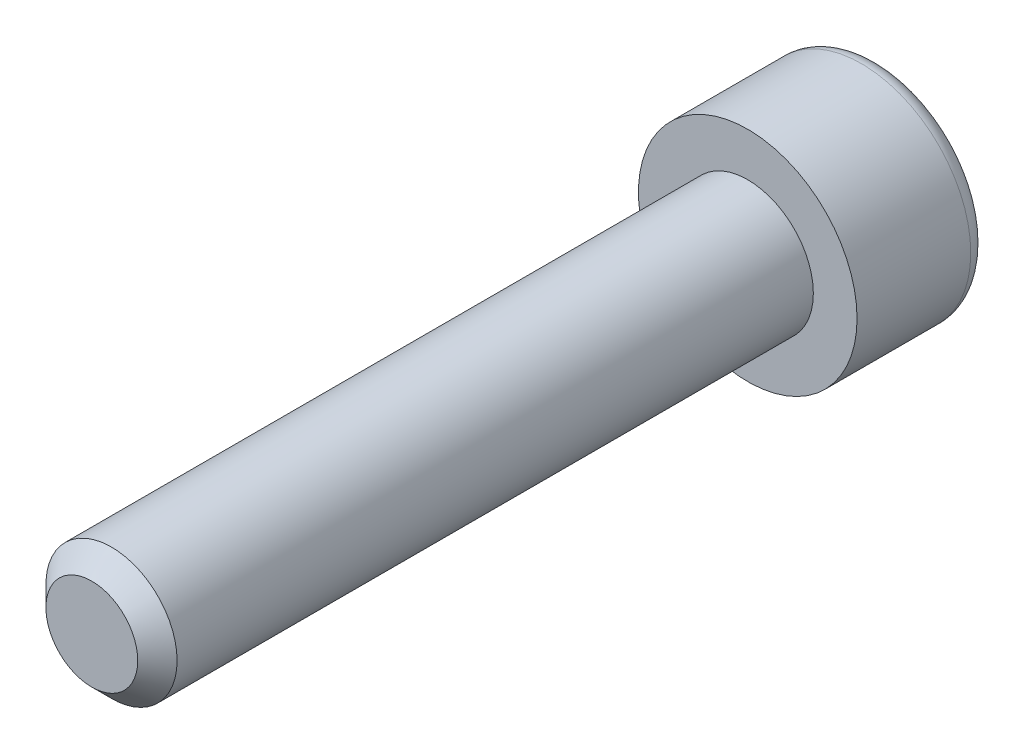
ISO-10303-21;
HEADER;
FILE_DESCRIPTION(('STEP AP214'),'2;1');
FILE_NAME('part.step','',(''),(''),'','','');
FILE_SCHEMA(('AUTOMOTIVE_DESIGN { 1 0 10303 214 1 1 1 1 }'));
ENDSEC;
DATA;
#1=APPLICATION_CONTEXT('core data for automotive mechanical design processes');
#2=APPLICATION_PROTOCOL_DEFINITION('international standard','automotive_design',2000,#1);
#3=PRODUCT_CONTEXT('',#1,'mechanical');
#4=PRODUCT('Part','Part','',(#3));
#5=PRODUCT_RELATED_PRODUCT_CATEGORY('part','',(#4));
#6=PRODUCT_DEFINITION_FORMATION('','',#4);
#7=PRODUCT_DEFINITION_CONTEXT('part definition',#1,'design');
#8=PRODUCT_DEFINITION('design','',#6,#7);
#9=PRODUCT_DEFINITION_SHAPE('','',#8);
#10=(LENGTH_UNIT() NAMED_UNIT(*) SI_UNIT(.MILLI.,.METRE.));
#11=(NAMED_UNIT(*) PLANE_ANGLE_UNIT() SI_UNIT($,.RADIAN.));
#12=(NAMED_UNIT(*) SI_UNIT($,.STERADIAN.) SOLID_ANGLE_UNIT());
#13=UNCERTAINTY_MEASURE_WITH_UNIT(LENGTH_MEASURE(1.E-05),#10,'distance_accuracy_value','');
#14=(GEOMETRIC_REPRESENTATION_CONTEXT(3) GLOBAL_UNCERTAINTY_ASSIGNED_CONTEXT((#13)) GLOBAL_UNIT_ASSIGNED_CONTEXT((#10,
#11,#12)) REPRESENTATION_CONTEXT('',''));
#15=CARTESIAN_POINT('',(0.,0.,0.));
#16=DIRECTION('',(0.,0.,1.));
#17=DIRECTION('',(1.,0.,0.));
#18=AXIS2_PLACEMENT_3D('',#15,#16,#17);
#19=CARTESIAN_POINT('',(0.,0.,-6.));
#20=DIRECTION('',(0.,0.,1.));
#21=DIRECTION('',(1.,0.,0.));
#22=AXIS2_PLACEMENT_3D('',#19,#20,#21);
#23=PLANE('',#22);
#24=CARTESIAN_POINT('',(0.,0.,-6.));
#25=DIRECTION('',(0.,0.,1.));
#26=DIRECTION('',(1.,0.,0.));
#27=AXIS2_PLACEMENT_3D('',#24,#25,#26);
#28=CIRCLE('',#27,4.2);
#29=CARTESIAN_POINT('',(4.2,0.,-6.));
#30=VERTEX_POINT('',#29);
#31=EDGE_CURVE('E11',#30,#30,#28,.F.);
#32=ORIENTED_EDGE('',*,*,#31,.T.);
#33=EDGE_LOOP('',(#32));
#34=FACE_BOUND('',#33,.T.);
#35=DIRECTION('',(0.866025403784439,-0.5,0.));
#36=VECTOR('',#35,1.);
#37=CARTESIAN_POINT('',(-2.5,-1.44337567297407,-6.));
#38=LINE('',#37,#36);
#39=CARTESIAN_POINT('',(-2.5,-1.44337567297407,-6.));
#40=VERTEX_POINT('',#39);
#41=CARTESIAN_POINT('',(0.,-2.88675134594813,-6.));
#42=VERTEX_POINT('',#41);
#43=EDGE_CURVE('E51',#40,#42,#38,.T.);
#44=ORIENTED_EDGE('',*,*,#43,.T.);
#45=DIRECTION('',(0.866025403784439,0.5,0.));
#46=VECTOR('',#45,1.);
#47=CARTESIAN_POINT('',(0.,-2.88675134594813,-6.));
#48=LINE('',#47,#46);
#49=CARTESIAN_POINT('',(2.5,-1.44337567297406,-6.));
#50=VERTEX_POINT('',#49);
#51=EDGE_CURVE('E122',#42,#50,#48,.T.);
#52=ORIENTED_EDGE('',*,*,#51,.T.);
#53=DIRECTION('',(0.,1.,0.));
#54=VECTOR('',#53,1.);
#55=CARTESIAN_POINT('',(2.5,-1.44337567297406,-6.));
#56=LINE('',#55,#54);
#57=CARTESIAN_POINT('',(2.5,1.44337567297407,-6.));
#58=VERTEX_POINT('',#57);
#59=EDGE_CURVE('E125',#50,#58,#56,.T.);
#60=ORIENTED_EDGE('',*,*,#59,.T.);
#61=DIRECTION('',(-0.866025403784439,0.5,0.));
#62=VECTOR('',#61,1.);
#63=CARTESIAN_POINT('',(2.5,1.44337567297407,-6.));
#64=LINE('',#63,#62);
#65=CARTESIAN_POINT('',(0.,2.88675134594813,-6.));
#66=VERTEX_POINT('',#65);
#67=EDGE_CURVE('E128',#58,#66,#64,.T.);
#68=ORIENTED_EDGE('',*,*,#67,.T.);
#69=DIRECTION('',(-0.866025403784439,-0.5,0.));
#70=VECTOR('',#69,1.);
#71=CARTESIAN_POINT('',(0.,2.88675134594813,-6.));
#72=LINE('',#71,#70);
#73=CARTESIAN_POINT('',(-2.5,1.44337567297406,-6.));
#74=VERTEX_POINT('',#73);
#75=EDGE_CURVE('E112',#66,#74,#72,.T.);
#76=ORIENTED_EDGE('',*,*,#75,.T.);
#77=DIRECTION('',(0.,-1.,0.));
#78=VECTOR('',#77,1.);
#79=CARTESIAN_POINT('',(-2.5,1.44337567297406,-6.));
#80=LINE('',#79,#78);
#81=EDGE_CURVE('E131',#74,#40,#80,.T.);
#82=ORIENTED_EDGE('',*,*,#81,.T.);
#83=EDGE_LOOP('',(#44,#52,#60,#68,#76,#82));
#84=FACE_BOUND('',#83,.T.);
#85=ADVANCED_FACE('F36',(#34,#84),#23,.F.);
#86=CARTESIAN_POINT('',(0.,0.,30.));
#87=DIRECTION('',(0.,0.,-1.));
#88=DIRECTION('',(-1.,0.,0.));
#89=AXIS2_PLACEMENT_3D('',#86,#87,#88);
#90=CYLINDRICAL_SURFACE('',#89,3.);
#91=CARTESIAN_POINT('',(0.,0.,29.1));
#92=DIRECTION('',(0.,0.,1.));
#93=DIRECTION('',(1.,0.,0.));
#94=AXIS2_PLACEMENT_3D('',#91,#92,#93);
#95=CIRCLE('',#94,3.);
#96=CARTESIAN_POINT('',(3.,0.,29.1));
#97=VERTEX_POINT('',#96);
#98=EDGE_CURVE('E151',#97,#97,#95,.F.);
#99=ORIENTED_EDGE('',*,*,#98,.T.);
#100=EDGE_LOOP('',(#99));
#101=FACE_BOUND('',#100,.T.);
#102=CARTESIAN_POINT('',(0.,0.,0.));
#103=DIRECTION('',(0.,0.,1.));
#104=DIRECTION('',(1.,0.,0.));
#105=AXIS2_PLACEMENT_3D('',#102,#103,#104);
#106=CIRCLE('',#105,3.);
#107=CARTESIAN_POINT('',(3.,0.,0.));
#108=VERTEX_POINT('',#107);
#109=EDGE_CURVE('E145',#108,#108,#106,.T.);
#110=ORIENTED_EDGE('',*,*,#109,.T.);
#111=EDGE_LOOP('',(#110));
#112=FACE_BOUND('',#111,.T.);
#113=ADVANCED_FACE('F168',(#101,#112),#90,.T.);
#114=CARTESIAN_POINT('',(0.,0.,30.));
#115=DIRECTION('',(0.,0.,1.));
#116=DIRECTION('',(1.,0.,0.));
#117=AXIS2_PLACEMENT_3D('',#114,#115,#116);
#118=PLANE('',#117);
#119=CARTESIAN_POINT('',(0.,0.,30.));
#120=DIRECTION('',(0.,0.,1.));
#121=DIRECTION('',(1.,0.,0.));
#122=AXIS2_PLACEMENT_3D('',#119,#120,#121);
#123=CIRCLE('',#122,2.1);
#124=CARTESIAN_POINT('',(2.1,0.,30.));
#125=VERTEX_POINT('',#124);
#126=EDGE_CURVE('E148',#125,#125,#123,.T.);
#127=ORIENTED_EDGE('',*,*,#126,.T.);
#128=EDGE_LOOP('',(#127));
#129=FACE_BOUND('',#128,.T.);
#130=ADVANCED_FACE('F174',(#129),#118,.T.);
#131=CARTESIAN_POINT('',(0.,0.,0.));
#132=DIRECTION('',(0.,0.,1.));
#133=DIRECTION('',(1.,0.,0.));
#134=AXIS2_PLACEMENT_3D('',#131,#132,#133);
#135=PLANE('',#134);
#136=CARTESIAN_POINT('',(0.,0.,0.));
#137=DIRECTION('',(0.,0.,1.));
#138=DIRECTION('',(1.,0.,0.));
#139=AXIS2_PLACEMENT_3D('',#136,#137,#138);
#140=CIRCLE('',#139,5.);
#141=CARTESIAN_POINT('',(5.,0.,0.));
#142=VERTEX_POINT('',#141);
#143=EDGE_CURVE('E142',#142,#142,#140,.T.);
#144=ORIENTED_EDGE('',*,*,#143,.T.);
#145=EDGE_LOOP('',(#144));
#146=FACE_BOUND('',#145,.T.);
#147=ORIENTED_EDGE('',*,*,#109,.F.);
#148=EDGE_LOOP('',(#147));
#149=FACE_BOUND('',#148,.T.);
#150=ADVANCED_FACE('F182',(#146,#149),#135,.T.);
#151=CARTESIAN_POINT('',(0.,0.,-6.));
#152=DIRECTION('',(0.,0.,1.));
#153=DIRECTION('',(1.,0.,0.));
#154=AXIS2_PLACEMENT_3D('',#151,#152,#153);
#155=CYLINDRICAL_SURFACE('',#154,5.);
#156=CARTESIAN_POINT('',(0.,0.,-5.2));
#157=DIRECTION('',(0.,0.,1.));
#158=DIRECTION('',(1.,0.,0.));
#159=AXIS2_PLACEMENT_3D('',#156,#157,#158);
#160=CIRCLE('',#159,5.);
#161=CARTESIAN_POINT('',(5.,0.,-5.2));
#162=VERTEX_POINT('',#161);
#163=EDGE_CURVE('E44',#162,#162,#160,.T.);
#164=ORIENTED_EDGE('',*,*,#163,.T.);
#165=EDGE_LOOP('',(#164));
#166=FACE_BOUND('',#165,.T.);
#167=ORIENTED_EDGE('',*,*,#143,.F.);
#168=EDGE_LOOP('',(#167));
#169=FACE_BOUND('',#168,.T.);
#170=ADVANCED_FACE('F156',(#166,#169),#155,.T.);
#171=CARTESIAN_POINT('',(-2.5,-1.44337567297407,-1.8));
#172=DIRECTION('',(0.5,0.866025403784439,0.));
#173=DIRECTION('',(-0.866025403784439,0.5,0.));
#174=AXIS2_PLACEMENT_3D('',#171,#172,#173);
#175=PLANE('',#174);
#176=ORIENTED_EDGE('',*,*,#43,.F.);
#177=DIRECTION('',(0.,0.,-1.));
#178=VECTOR('',#177,1.);
#179=CARTESIAN_POINT('',(-2.5,-1.44337567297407,-1.8));
#180=LINE('',#179,#178);
#181=CARTESIAN_POINT('',(-2.5,-1.44337567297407,-1.8));
#182=VERTEX_POINT('',#181);
#183=EDGE_CURVE('E117',#182,#40,#180,.T.);
#184=ORIENTED_EDGE('',*,*,#183,.F.);
#185=DIRECTION('',(0.866025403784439,-0.5,0.));
#186=VECTOR('',#185,1.);
#187=CARTESIAN_POINT('',(-2.5,-1.44337567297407,-1.8));
#188=LINE('',#187,#186);
#189=CARTESIAN_POINT('',(0.,-2.88675134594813,-1.8));
#190=VERTEX_POINT('',#189);
#191=EDGE_CURVE('E134',#182,#190,#188,.T.);
#192=ORIENTED_EDGE('',*,*,#191,.T.);
#193=DIRECTION('',(0.,0.,-1.));
#194=VECTOR('',#193,1.);
#195=CARTESIAN_POINT('',(0.,-2.88675134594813,-1.8));
#196=LINE('',#195,#194);
#197=EDGE_CURVE('E140',#190,#42,#196,.T.);
#198=ORIENTED_EDGE('',*,*,#197,.T.);
#199=EDGE_LOOP('',(#176,#184,#192,#198));
#200=FACE_BOUND('',#199,.T.);
#201=ADVANCED_FACE('F180',(#200),#175,.T.);
#202=CARTESIAN_POINT('',(0.,-2.88675134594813,-1.8));
#203=DIRECTION('',(-0.5,0.866025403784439,0.));
#204=DIRECTION('',(-0.866025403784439,-0.5,0.));
#205=AXIS2_PLACEMENT_3D('',#202,#203,#204);
#206=PLANE('',#205);
#207=ORIENTED_EDGE('',*,*,#51,.F.);
#208=ORIENTED_EDGE('',*,*,#197,.F.);
#209=DIRECTION('',(0.866025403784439,0.5,0.));
#210=VECTOR('',#209,1.);
#211=CARTESIAN_POINT('',(0.,-2.88675134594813,-1.8));
#212=LINE('',#211,#210);
#213=CARTESIAN_POINT('',(2.5,-1.44337567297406,-1.8));
#214=VERTEX_POINT('',#213);
#215=EDGE_CURVE('E90',#190,#214,#212,.T.);
#216=ORIENTED_EDGE('',*,*,#215,.T.);
#217=DIRECTION('',(0.,0.,-1.));
#218=VECTOR('',#217,1.);
#219=CARTESIAN_POINT('',(2.5,-1.44337567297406,-1.8));
#220=LINE('',#219,#218);
#221=EDGE_CURVE('E138',#214,#50,#220,.T.);
#222=ORIENTED_EDGE('',*,*,#221,.T.);
#223=EDGE_LOOP('',(#207,#208,#216,#222));
#224=FACE_BOUND('',#223,.T.);
#225=ADVANCED_FACE('F212',(#224),#206,.T.);
#226=CARTESIAN_POINT('',(2.5,-1.44337567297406,-1.8));
#227=DIRECTION('',(-1.,0.,0.));
#228=DIRECTION('',(0.,-1.,0.));
#229=AXIS2_PLACEMENT_3D('',#226,#227,#228);
#230=PLANE('',#229);
#231=ORIENTED_EDGE('',*,*,#59,.F.);
#232=ORIENTED_EDGE('',*,*,#221,.F.);
#233=DIRECTION('',(0.,1.,0.));
#234=VECTOR('',#233,1.);
#235=CARTESIAN_POINT('',(2.5,-1.44337567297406,-1.8));
#236=LINE('',#235,#234);
#237=CARTESIAN_POINT('',(2.5,1.44337567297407,-1.8));
#238=VERTEX_POINT('',#237);
#239=EDGE_CURVE('E108',#214,#238,#236,.T.);
#240=ORIENTED_EDGE('',*,*,#239,.T.);
#241=DIRECTION('',(0.,0.,-1.));
#242=VECTOR('',#241,1.);
#243=CARTESIAN_POINT('',(2.5,1.44337567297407,-1.8));
#244=LINE('',#243,#242);
#245=EDGE_CURVE('E105',#238,#58,#244,.T.);
#246=ORIENTED_EDGE('',*,*,#245,.T.);
#247=EDGE_LOOP('',(#231,#232,#240,#246));
#248=FACE_BOUND('',#247,.T.);
#249=ADVANCED_FACE('F218',(#248),#230,.T.);
#250=CARTESIAN_POINT('',(2.5,1.44337567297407,-1.8));
#251=DIRECTION('',(-0.5,-0.866025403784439,0.));
#252=DIRECTION('',(0.866025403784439,-0.5,0.));
#253=AXIS2_PLACEMENT_3D('',#250,#251,#252);
#254=PLANE('',#253);
#255=ORIENTED_EDGE('',*,*,#67,.F.);
#256=ORIENTED_EDGE('',*,*,#245,.F.);
#257=DIRECTION('',(-0.866025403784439,0.5,0.));
#258=VECTOR('',#257,1.);
#259=CARTESIAN_POINT('',(2.5,1.44337567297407,-1.8));
#260=LINE('',#259,#258);
#261=CARTESIAN_POINT('',(0.,2.88675134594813,-1.8));
#262=VERTEX_POINT('',#261);
#263=EDGE_CURVE('E100',#238,#262,#260,.T.);
#264=ORIENTED_EDGE('',*,*,#263,.T.);
#265=DIRECTION('',(0.,0.,-1.));
#266=VECTOR('',#265,1.);
#267=CARTESIAN_POINT('',(0.,2.88675134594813,-1.8));
#268=LINE('',#267,#266);
#269=EDGE_CURVE('E104',#262,#66,#268,.T.);
#270=ORIENTED_EDGE('',*,*,#269,.T.);
#271=EDGE_LOOP('',(#255,#256,#264,#270));
#272=FACE_BOUND('',#271,.T.);
#273=ADVANCED_FACE('F103',(#272),#254,.T.);
#274=CARTESIAN_POINT('',(0.,2.88675134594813,-1.8));
#275=DIRECTION('',(0.5,-0.866025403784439,0.));
#276=DIRECTION('',(0.866025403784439,0.5,0.));
#277=AXIS2_PLACEMENT_3D('',#274,#275,#276);
#278=PLANE('',#277);
#279=ORIENTED_EDGE('',*,*,#75,.F.);
#280=ORIENTED_EDGE('',*,*,#269,.F.);
#281=DIRECTION('',(-0.866025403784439,-0.5,0.));
#282=VECTOR('',#281,1.);
#283=CARTESIAN_POINT('',(0.,2.88675134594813,-1.8));
#284=LINE('',#283,#282);
#285=CARTESIAN_POINT('',(-2.5,1.44337567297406,-1.8));
#286=VERTEX_POINT('',#285);
#287=EDGE_CURVE('E107',#262,#286,#284,.T.);
#288=ORIENTED_EDGE('',*,*,#287,.T.);
#289=DIRECTION('',(0.,0.,-1.));
#290=VECTOR('',#289,1.);
#291=CARTESIAN_POINT('',(-2.5,1.44337567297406,-1.8));
#292=LINE('',#291,#290);
#293=EDGE_CURVE('E81',#286,#74,#292,.T.);
#294=ORIENTED_EDGE('',*,*,#293,.T.);
#295=EDGE_LOOP('',(#279,#280,#288,#294));
#296=FACE_BOUND('',#295,.T.);
#297=ADVANCED_FACE('F110',(#296),#278,.T.);
#298=CARTESIAN_POINT('',(-2.5,1.44337567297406,-1.8));
#299=DIRECTION('',(1.,0.,0.));
#300=DIRECTION('',(0.,1.,0.));
#301=AXIS2_PLACEMENT_3D('',#298,#299,#300);
#302=PLANE('',#301);
#303=ORIENTED_EDGE('',*,*,#81,.F.);
#304=ORIENTED_EDGE('',*,*,#293,.F.);
#305=DIRECTION('',(0.,-1.,0.));
#306=VECTOR('',#305,1.);
#307=CARTESIAN_POINT('',(-2.5,1.44337567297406,-1.8));
#308=LINE('',#307,#306);
#309=EDGE_CURVE('E59',#286,#182,#308,.T.);
#310=ORIENTED_EDGE('',*,*,#309,.T.);
#311=ORIENTED_EDGE('',*,*,#183,.T.);
#312=EDGE_LOOP('',(#303,#304,#310,#311));
#313=FACE_BOUND('',#312,.T.);
#314=ADVANCED_FACE('F238',(#313),#302,.T.);
#315=CARTESIAN_POINT('',(2.5,-4.33012701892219,-1.8));
#316=DIRECTION('',(0.,0.,1.));
#317=DIRECTION('',(1.,0.,0.));
#318=AXIS2_PLACEMENT_3D('',#315,#316,#317);
#319=PLANE('',#318);
#320=ORIENTED_EDGE('',*,*,#191,.F.);
#321=ORIENTED_EDGE('',*,*,#309,.F.);
#322=ORIENTED_EDGE('',*,*,#287,.F.);
#323=ORIENTED_EDGE('',*,*,#263,.F.);
#324=ORIENTED_EDGE('',*,*,#239,.F.);
#325=ORIENTED_EDGE('',*,*,#215,.F.);
#326=EDGE_LOOP('',(#320,#321,#322,#323,#324,#325));
#327=FACE_BOUND('',#326,.T.);
#328=ADVANCED_FACE('F115',(#327),#319,.F.);
#329=CARTESIAN_POINT('',(0.,0.,30.));
#330=DIRECTION('',(0.,0.,-1.));
#331=DIRECTION('',(-1.,0.,0.));
#332=AXIS2_PLACEMENT_3D('',#329,#330,#331);
#333=CONICAL_SURFACE('',#332,2.1,0.785398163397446);
#334=ORIENTED_EDGE('',*,*,#98,.F.);
#335=EDGE_LOOP('',(#334));
#336=FACE_BOUND('',#335,.T.);
#337=ORIENTED_EDGE('',*,*,#126,.F.);
#338=EDGE_LOOP('',(#337));
#339=FACE_BOUND('',#338,.T.);
#340=ADVANCED_FACE('F160',(#336,#339),#333,.T.);
#341=CARTESIAN_POINT('',(0.,0.,-5.2));
#342=DIRECTION('',(0.,0.,1.));
#343=DIRECTION('',(1.,0.,0.));
#344=AXIS2_PLACEMENT_3D('',#341,#342,#343);
#345=TOROIDAL_SURFACE('',#344,4.2,0.8);
#346=ORIENTED_EDGE('',*,*,#31,.F.);
#347=EDGE_LOOP('',(#346));
#348=FACE_BOUND('',#347,.T.);
#349=ORIENTED_EDGE('',*,*,#163,.F.);
#350=EDGE_LOOP('',(#349));
#351=FACE_BOUND('',#350,.T.);
#352=ADVANCED_FACE('F38',(#348,#351),#345,.T.);
#353=CLOSED_SHELL('',(#85,#113,#130,#150,#170,#201,#225,#249,#273,#297,#314,#328,#340,#352));
#354=MANIFOLD_SOLID_BREP('B2',#353);
#355=ADVANCED_BREP_SHAPE_REPRESENTATION('',(#18,#354),#14);
#356=SHAPE_DEFINITION_REPRESENTATION(#9,#355);
ENDSEC;
END-ISO-10303-21;
